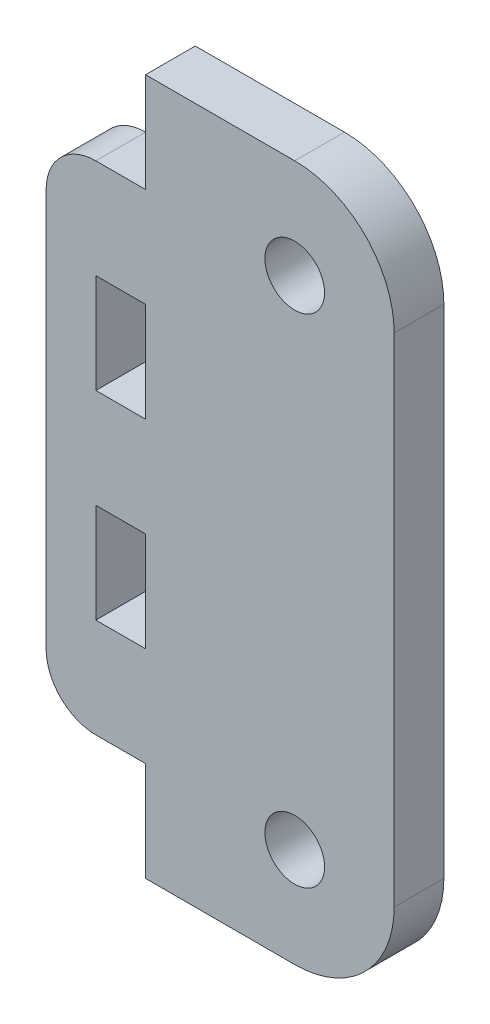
ISO-10303-21;
HEADER;
FILE_DESCRIPTION(('STEP AP214'),'2;1');
FILE_NAME('part.step','',(''),(''),'','','');
FILE_SCHEMA(('AUTOMOTIVE_DESIGN { 1 0 10303 214 1 1 1 1 }'));
ENDSEC;
DATA;
#1=APPLICATION_CONTEXT('core data for automotive mechanical design processes');
#2=APPLICATION_PROTOCOL_DEFINITION('international standard','automotive_design',2000,#1);
#3=PRODUCT_CONTEXT('',#1,'mechanical');
#4=PRODUCT('Part','Part','',(#3));
#5=PRODUCT_RELATED_PRODUCT_CATEGORY('part','',(#4));
#6=PRODUCT_DEFINITION_FORMATION('','',#4);
#7=PRODUCT_DEFINITION_CONTEXT('part definition',#1,'design');
#8=PRODUCT_DEFINITION('design','',#6,#7);
#9=PRODUCT_DEFINITION_SHAPE('','',#8);
#10=(LENGTH_UNIT() NAMED_UNIT(*) SI_UNIT(.MILLI.,.METRE.));
#11=(NAMED_UNIT(*) PLANE_ANGLE_UNIT() SI_UNIT($,.RADIAN.));
#12=(NAMED_UNIT(*) SI_UNIT($,.STERADIAN.) SOLID_ANGLE_UNIT());
#13=UNCERTAINTY_MEASURE_WITH_UNIT(LENGTH_MEASURE(1.E-05),#10,'distance_accuracy_value','');
#14=(GEOMETRIC_REPRESENTATION_CONTEXT(3) GLOBAL_UNCERTAINTY_ASSIGNED_CONTEXT((#13)) GLOBAL_UNIT_ASSIGNED_CONTEXT((#10,
#11,#12)) REPRESENTATION_CONTEXT('',''));
#15=CARTESIAN_POINT('',(0.,0.,0.));
#16=DIRECTION('',(0.,0.,1.));
#17=DIRECTION('',(1.,0.,0.));
#18=AXIS2_PLACEMENT_3D('',#15,#16,#17);
#19=CARTESIAN_POINT('',(0.,0.,5.));
#20=DIRECTION('',(0.,0.,1.));
#21=DIRECTION('',(1.,0.,0.));
#22=AXIS2_PLACEMENT_3D('',#19,#20,#21);
#23=PLANE('',#22);
#24=DIRECTION('',(1.,0.,0.));
#25=VECTOR('',#24,1.);
#26=CARTESIAN_POINT('',(0.,25.,5.));
#27=LINE('',#26,#25);
#28=CARTESIAN_POINT('',(-5.,25.,5.));
#29=VERTEX_POINT('',#28);
#30=CARTESIAN_POINT('',(0.,25.,5.));
#31=VERTEX_POINT('',#30);
#32=EDGE_CURVE('E186',#29,#31,#27,.T.);
#33=ORIENTED_EDGE('',*,*,#32,.F.);
#34=CARTESIAN_POINT('',(-5.,20.,5.));
#35=DIRECTION('',(0.,0.,1.));
#36=DIRECTION('',(1.,0.,0.));
#37=AXIS2_PLACEMENT_3D('',#34,#35,#36);
#38=CIRCLE('',#37,5.);
#39=CARTESIAN_POINT('',(-10.,20.,5.));
#40=VERTEX_POINT('',#39);
#41=EDGE_CURVE('E311',#29,#40,#38,.T.);
#42=ORIENTED_EDGE('',*,*,#41,.T.);
#43=DIRECTION('',(0.,1.,0.));
#44=VECTOR('',#43,1.);
#45=CARTESIAN_POINT('',(-10.,-25.,5.));
#46=LINE('',#45,#44);
#47=CARTESIAN_POINT('',(-10.,-20.,5.));
#48=VERTEX_POINT('',#47);
#49=EDGE_CURVE('E330',#48,#40,#46,.T.);
#50=ORIENTED_EDGE('',*,*,#49,.F.);
#51=CARTESIAN_POINT('',(-5.,-20.,5.));
#52=DIRECTION('',(0.,0.,1.));
#53=DIRECTION('',(1.,0.,0.));
#54=AXIS2_PLACEMENT_3D('',#51,#52,#53);
#55=CIRCLE('',#54,5.);
#56=CARTESIAN_POINT('',(-5.,-25.,5.));
#57=VERTEX_POINT('',#56);
#58=EDGE_CURVE('E309',#48,#57,#55,.T.);
#59=ORIENTED_EDGE('',*,*,#58,.T.);
#60=DIRECTION('',(-1.,0.,0.));
#61=VECTOR('',#60,1.);
#62=CARTESIAN_POINT('',(0.,-25.,5.));
#63=LINE('',#62,#61);
#64=CARTESIAN_POINT('',(0.,-25.,5.));
#65=VERTEX_POINT('',#64);
#66=EDGE_CURVE('E194',#65,#57,#63,.T.);
#67=ORIENTED_EDGE('',*,*,#66,.F.);
#68=DIRECTION('',(0.,-1.,0.));
#69=VECTOR('',#68,1.);
#70=CARTESIAN_POINT('',(0.,35.,5.));
#71=LINE('',#70,#69);
#72=CARTESIAN_POINT('',(0.,-35.,5.));
#73=VERTEX_POINT('',#72);
#74=EDGE_CURVE('E191',#65,#73,#71,.T.);
#75=ORIENTED_EDGE('',*,*,#74,.T.);
#76=DIRECTION('',(-1.,0.,0.));
#77=VECTOR('',#76,1.);
#78=CARTESIAN_POINT('',(25.,-35.,5.));
#79=LINE('',#78,#77);
#80=CARTESIAN_POINT('',(15.,-35.,5.));
#81=VERTEX_POINT('',#80);
#82=EDGE_CURVE('E175',#81,#73,#79,.T.);
#83=ORIENTED_EDGE('',*,*,#82,.F.);
#84=CARTESIAN_POINT('',(15.,-25.,5.));
#85=DIRECTION('',(0.,0.,1.));
#86=DIRECTION('',(1.,0.,0.));
#87=AXIS2_PLACEMENT_3D('',#84,#85,#86);
#88=CIRCLE('',#87,10.);
#89=CARTESIAN_POINT('',(25.,-25.,5.));
#90=VERTEX_POINT('',#89);
#91=EDGE_CURVE('E293',#81,#90,#88,.T.);
#92=ORIENTED_EDGE('',*,*,#91,.T.);
#93=DIRECTION('',(0.,-1.,0.));
#94=VECTOR('',#93,1.);
#95=CARTESIAN_POINT('',(25.,35.,5.));
#96=LINE('',#95,#94);
#97=CARTESIAN_POINT('',(25.,25.,5.));
#98=VERTEX_POINT('',#97);
#99=EDGE_CURVE('E217',#98,#90,#96,.T.);
#100=ORIENTED_EDGE('',*,*,#99,.F.);
#101=CARTESIAN_POINT('',(15.,25.,5.));
#102=DIRECTION('',(0.,0.,1.));
#103=DIRECTION('',(1.,0.,0.));
#104=AXIS2_PLACEMENT_3D('',#101,#102,#103);
#105=CIRCLE('',#104,10.);
#106=CARTESIAN_POINT('',(15.,35.,5.));
#107=VERTEX_POINT('',#106);
#108=EDGE_CURVE('E295',#98,#107,#105,.T.);
#109=ORIENTED_EDGE('',*,*,#108,.T.);
#110=DIRECTION('',(-1.,0.,0.));
#111=VECTOR('',#110,1.);
#112=CARTESIAN_POINT('',(25.,35.,5.));
#113=LINE('',#112,#111);
#114=CARTESIAN_POINT('',(0.,35.,5.));
#115=VERTEX_POINT('',#114);
#116=EDGE_CURVE('E218',#107,#115,#113,.T.);
#117=ORIENTED_EDGE('',*,*,#116,.T.);
#118=EDGE_CURVE('E200',#115,#31,#71,.T.);
#119=ORIENTED_EDGE('',*,*,#118,.T.);
#120=EDGE_LOOP('',(#33,#42,#50,#59,#67,#75,#83,#92,#100,#109,#117,#119));
#121=FACE_BOUND('',#120,.T.);
#122=CARTESIAN_POINT('',(15.,-25.,5.));
#123=DIRECTION('',(0.,0.,1.));
#124=DIRECTION('',(1.,0.,0.));
#125=AXIS2_PLACEMENT_3D('',#122,#123,#124);
#126=CIRCLE('',#125,3.);
#127=CARTESIAN_POINT('',(18.,-25.,5.));
#128=VERTEX_POINT('',#127);
#129=EDGE_CURVE('E333',#128,#128,#126,.T.);
#130=ORIENTED_EDGE('',*,*,#129,.F.);
#131=EDGE_LOOP('',(#130));
#132=FACE_BOUND('',#131,.T.);
#133=CARTESIAN_POINT('',(15.,25.,5.));
#134=DIRECTION('',(0.,0.,1.));
#135=DIRECTION('',(1.,0.,0.));
#136=AXIS2_PLACEMENT_3D('',#133,#134,#135);
#137=CIRCLE('',#136,3.);
#138=CARTESIAN_POINT('',(18.,25.,5.));
#139=VERTEX_POINT('',#138);
#140=EDGE_CURVE('E340',#139,#139,#137,.T.);
#141=ORIENTED_EDGE('',*,*,#140,.F.);
#142=EDGE_LOOP('',(#141));
#143=FACE_BOUND('',#142,.T.);
#144=CARTESIAN_POINT('',(0.,-5.,5.));
#145=VERTEX_POINT('',#144);
#146=CARTESIAN_POINT('',(0.,-15.,5.));
#147=VERTEX_POINT('',#146);
#148=EDGE_CURVE('E197',#145,#147,#71,.T.);
#149=ORIENTED_EDGE('',*,*,#148,.T.);
#150=DIRECTION('',(1.,0.,0.));
#151=VECTOR('',#150,1.);
#152=CARTESIAN_POINT('',(0.,-15.,5.));
#153=LINE('',#152,#151);
#154=CARTESIAN_POINT('',(-5.,-15.,5.));
#155=VERTEX_POINT('',#154);
#156=EDGE_CURVE('E239',#155,#147,#153,.T.);
#157=ORIENTED_EDGE('',*,*,#156,.F.);
#158=DIRECTION('',(0.,-1.,0.));
#159=VECTOR('',#158,1.);
#160=CARTESIAN_POINT('',(-5.,-15.,5.));
#161=LINE('',#160,#159);
#162=CARTESIAN_POINT('',(-5.,-5.,5.));
#163=VERTEX_POINT('',#162);
#164=EDGE_CURVE('E250',#163,#155,#161,.T.);
#165=ORIENTED_EDGE('',*,*,#164,.F.);
#166=DIRECTION('',(-1.,0.,0.));
#167=VECTOR('',#166,1.);
#168=CARTESIAN_POINT('',(0.,-5.,5.));
#169=LINE('',#168,#167);
#170=EDGE_CURVE('E247',#145,#163,#169,.T.);
#171=ORIENTED_EDGE('',*,*,#170,.F.);
#172=EDGE_LOOP('',(#149,#157,#165,#171));
#173=FACE_BOUND('',#172,.T.);
#174=CARTESIAN_POINT('',(0.,15.,5.));
#175=VERTEX_POINT('',#174);
#176=CARTESIAN_POINT('',(0.,5.,5.));
#177=VERTEX_POINT('',#176);
#178=EDGE_CURVE('E210',#175,#177,#71,.T.);
#179=ORIENTED_EDGE('',*,*,#178,.T.);
#180=DIRECTION('',(1.,0.,0.));
#181=VECTOR('',#180,1.);
#182=CARTESIAN_POINT('',(0.,5.,5.));
#183=LINE('',#182,#181);
#184=CARTESIAN_POINT('',(-5.,5.,5.));
#185=VERTEX_POINT('',#184);
#186=EDGE_CURVE('E228',#185,#177,#183,.T.);
#187=ORIENTED_EDGE('',*,*,#186,.F.);
#188=DIRECTION('',(0.,-1.,0.));
#189=VECTOR('',#188,1.);
#190=CARTESIAN_POINT('',(-5.,5.,5.));
#191=LINE('',#190,#189);
#192=CARTESIAN_POINT('',(-5.,15.,5.));
#193=VERTEX_POINT('',#192);
#194=EDGE_CURVE('E233',#193,#185,#191,.T.);
#195=ORIENTED_EDGE('',*,*,#194,.F.);
#196=DIRECTION('',(-1.,0.,0.));
#197=VECTOR('',#196,1.);
#198=CARTESIAN_POINT('',(0.,15.,5.));
#199=LINE('',#198,#197);
#200=EDGE_CURVE('E230',#175,#193,#199,.T.);
#201=ORIENTED_EDGE('',*,*,#200,.F.);
#202=EDGE_LOOP('',(#179,#187,#195,#201));
#203=FACE_BOUND('',#202,.T.);
#204=ADVANCED_FACE('F37',(#121,#132,#143,#173,#203),#23,.T.);
#205=CARTESIAN_POINT('',(0.,0.,0.));
#206=DIRECTION('',(0.,0.,1.));
#207=DIRECTION('',(1.,0.,0.));
#208=AXIS2_PLACEMENT_3D('',#205,#206,#207);
#209=PLANE('',#208);
#210=CARTESIAN_POINT('',(15.,-25.,0.));
#211=DIRECTION('',(0.,0.,1.));
#212=DIRECTION('',(1.,0.,0.));
#213=AXIS2_PLACEMENT_3D('',#210,#211,#212);
#214=CIRCLE('',#213,3.);
#215=CARTESIAN_POINT('',(18.,-25.,0.));
#216=VERTEX_POINT('',#215);
#217=EDGE_CURVE('E336',#216,#216,#214,.T.);
#218=ORIENTED_EDGE('',*,*,#217,.T.);
#219=EDGE_LOOP('',(#218));
#220=FACE_BOUND('',#219,.T.);
#221=CARTESIAN_POINT('',(15.,25.,0.));
#222=DIRECTION('',(0.,0.,1.));
#223=DIRECTION('',(1.,0.,0.));
#224=AXIS2_PLACEMENT_3D('',#221,#222,#223);
#225=CIRCLE('',#224,3.);
#226=CARTESIAN_POINT('',(18.,25.,0.));
#227=VERTEX_POINT('',#226);
#228=EDGE_CURVE('E198',#227,#227,#225,.T.);
#229=ORIENTED_EDGE('',*,*,#228,.T.);
#230=EDGE_LOOP('',(#229));
#231=FACE_BOUND('',#230,.T.);
#232=DIRECTION('',(1.,0.,0.));
#233=VECTOR('',#232,1.);
#234=CARTESIAN_POINT('',(0.,-15.,0.));
#235=LINE('',#234,#233);
#236=CARTESIAN_POINT('',(-5.,-15.,0.));
#237=VERTEX_POINT('',#236);
#238=CARTESIAN_POINT('',(0.,-15.,0.));
#239=VERTEX_POINT('',#238);
#240=EDGE_CURVE('E273',#237,#239,#235,.T.);
#241=ORIENTED_EDGE('',*,*,#240,.T.);
#242=DIRECTION('',(0.,1.,0.));
#243=VECTOR('',#242,1.);
#244=CARTESIAN_POINT('',(0.,35.,0.));
#245=LINE('',#244,#243);
#246=CARTESIAN_POINT('',(0.,-5.,0.));
#247=VERTEX_POINT('',#246);
#248=EDGE_CURVE('E214',#239,#247,#245,.T.);
#249=ORIENTED_EDGE('',*,*,#248,.T.);
#250=DIRECTION('',(-1.,0.,0.));
#251=VECTOR('',#250,1.);
#252=CARTESIAN_POINT('',(0.,-5.,0.));
#253=LINE('',#252,#251);
#254=CARTESIAN_POINT('',(-5.,-5.,0.));
#255=VERTEX_POINT('',#254);
#256=EDGE_CURVE('E267',#247,#255,#253,.T.);
#257=ORIENTED_EDGE('',*,*,#256,.T.);
#258=DIRECTION('',(0.,-1.,0.));
#259=VECTOR('',#258,1.);
#260=CARTESIAN_POINT('',(-5.,0.,0.));
#261=LINE('',#260,#259);
#262=EDGE_CURVE('E270',#255,#237,#261,.T.);
#263=ORIENTED_EDGE('',*,*,#262,.T.);
#264=EDGE_LOOP('',(#241,#249,#257,#263));
#265=FACE_BOUND('',#264,.T.);
#266=DIRECTION('',(1.,0.,0.));
#267=VECTOR('',#266,1.);
#268=CARTESIAN_POINT('',(0.,5.,0.));
#269=LINE('',#268,#267);
#270=CARTESIAN_POINT('',(-5.,5.,0.));
#271=VERTEX_POINT('',#270);
#272=CARTESIAN_POINT('',(0.,5.,0.));
#273=VERTEX_POINT('',#272);
#274=EDGE_CURVE('E282',#271,#273,#269,.T.);
#275=ORIENTED_EDGE('',*,*,#274,.T.);
#276=CARTESIAN_POINT('',(0.,15.,0.));
#277=VERTEX_POINT('',#276);
#278=EDGE_CURVE('E207',#273,#277,#245,.T.);
#279=ORIENTED_EDGE('',*,*,#278,.T.);
#280=DIRECTION('',(-1.,0.,0.));
#281=VECTOR('',#280,1.);
#282=CARTESIAN_POINT('',(0.,15.,0.));
#283=LINE('',#282,#281);
#284=CARTESIAN_POINT('',(-5.,15.,0.));
#285=VERTEX_POINT('',#284);
#286=EDGE_CURVE('E276',#277,#285,#283,.T.);
#287=ORIENTED_EDGE('',*,*,#286,.T.);
#288=DIRECTION('',(0.,-1.,0.));
#289=VECTOR('',#288,1.);
#290=CARTESIAN_POINT('',(-5.,0.,0.));
#291=LINE('',#290,#289);
#292=EDGE_CURVE('E279',#285,#271,#291,.T.);
#293=ORIENTED_EDGE('',*,*,#292,.T.);
#294=EDGE_LOOP('',(#275,#279,#287,#293));
#295=FACE_BOUND('',#294,.T.);
#296=DIRECTION('',(0.,1.,0.));
#297=VECTOR('',#296,1.);
#298=CARTESIAN_POINT('',(-10.,0.,0.));
#299=LINE('',#298,#297);
#300=CARTESIAN_POINT('',(-10.,-20.,0.));
#301=VERTEX_POINT('',#300);
#302=CARTESIAN_POINT('',(-10.,20.,0.));
#303=VERTEX_POINT('',#302);
#304=EDGE_CURVE('E304',#301,#303,#299,.T.);
#305=ORIENTED_EDGE('',*,*,#304,.T.);
#306=CARTESIAN_POINT('',(-5.,20.,0.));
#307=DIRECTION('',(0.,0.,1.));
#308=DIRECTION('',(1.,0.,0.));
#309=AXIS2_PLACEMENT_3D('',#306,#307,#308);
#310=CIRCLE('',#309,5.);
#311=CARTESIAN_POINT('',(-5.,25.,0.));
#312=VERTEX_POINT('',#311);
#313=EDGE_CURVE('E45',#303,#312,#310,.F.);
#314=ORIENTED_EDGE('',*,*,#313,.T.);
#315=DIRECTION('',(1.,0.,0.));
#316=VECTOR('',#315,1.);
#317=CARTESIAN_POINT('',(0.,25.,0.));
#318=LINE('',#317,#316);
#319=CARTESIAN_POINT('',(0.,25.,0.));
#320=VERTEX_POINT('',#319);
#321=EDGE_CURVE('E285',#312,#320,#318,.T.);
#322=ORIENTED_EDGE('',*,*,#321,.T.);
#323=CARTESIAN_POINT('',(0.,35.,0.));
#324=VERTEX_POINT('',#323);
#325=EDGE_CURVE('E204',#320,#324,#245,.T.);
#326=ORIENTED_EDGE('',*,*,#325,.T.);
#327=DIRECTION('',(-1.,0.,0.));
#328=VECTOR('',#327,1.);
#329=CARTESIAN_POINT('',(25.,35.,0.));
#330=LINE('',#329,#328);
#331=CARTESIAN_POINT('',(15.,35.,0.));
#332=VERTEX_POINT('',#331);
#333=EDGE_CURVE('E220',#332,#324,#330,.T.);
#334=ORIENTED_EDGE('',*,*,#333,.F.);
#335=CARTESIAN_POINT('',(15.,25.,0.));
#336=DIRECTION('',(0.,0.,1.));
#337=DIRECTION('',(1.,0.,0.));
#338=AXIS2_PLACEMENT_3D('',#335,#336,#337);
#339=CIRCLE('',#338,10.);
#340=CARTESIAN_POINT('',(25.,25.,0.));
#341=VERTEX_POINT('',#340);
#342=EDGE_CURVE('E301',#332,#341,#339,.F.);
#343=ORIENTED_EDGE('',*,*,#342,.T.);
#344=DIRECTION('',(0.,1.,0.));
#345=VECTOR('',#344,1.);
#346=CARTESIAN_POINT('',(25.,35.,0.));
#347=LINE('',#346,#345);
#348=CARTESIAN_POINT('',(25.,-25.,0.));
#349=VERTEX_POINT('',#348);
#350=EDGE_CURVE('E221',#349,#341,#347,.T.);
#351=ORIENTED_EDGE('',*,*,#350,.F.);
#352=CARTESIAN_POINT('',(15.,-25.,0.));
#353=DIRECTION('',(0.,0.,1.));
#354=DIRECTION('',(1.,0.,0.));
#355=AXIS2_PLACEMENT_3D('',#352,#353,#354);
#356=CIRCLE('',#355,10.);
#357=CARTESIAN_POINT('',(15.,-35.,0.));
#358=VERTEX_POINT('',#357);
#359=EDGE_CURVE('E299',#349,#358,#356,.F.);
#360=ORIENTED_EDGE('',*,*,#359,.T.);
#361=DIRECTION('',(-1.,0.,0.));
#362=VECTOR('',#361,1.);
#363=CARTESIAN_POINT('',(25.,-35.,0.));
#364=LINE('',#363,#362);
#365=CARTESIAN_POINT('',(0.,-35.,0.));
#366=VERTEX_POINT('',#365);
#367=EDGE_CURVE('E187',#358,#366,#364,.T.);
#368=ORIENTED_EDGE('',*,*,#367,.T.);
#369=CARTESIAN_POINT('',(0.,-25.,0.));
#370=VERTEX_POINT('',#369);
#371=EDGE_CURVE('E203',#366,#370,#245,.T.);
#372=ORIENTED_EDGE('',*,*,#371,.T.);
#373=DIRECTION('',(-1.,0.,0.));
#374=VECTOR('',#373,1.);
#375=CARTESIAN_POINT('',(0.,-25.,0.));
#376=LINE('',#375,#374);
#377=CARTESIAN_POINT('',(-5.,-25.,0.));
#378=VERTEX_POINT('',#377);
#379=EDGE_CURVE('E265',#370,#378,#376,.T.);
#380=ORIENTED_EDGE('',*,*,#379,.T.);
#381=CARTESIAN_POINT('',(-5.,-20.,0.));
#382=DIRECTION('',(0.,0.,1.));
#383=DIRECTION('',(1.,0.,0.));
#384=AXIS2_PLACEMENT_3D('',#381,#382,#383);
#385=CIRCLE('',#384,5.);
#386=EDGE_CURVE('E317',#378,#301,#385,.F.);
#387=ORIENTED_EDGE('',*,*,#386,.T.);
#388=EDGE_LOOP('',(#305,#314,#322,#326,#334,#343,#351,#360,#368,#372,#380,#387));
#389=FACE_BOUND('',#388,.T.);
#390=ADVANCED_FACE('F321',(#220,#231,#265,#295,#389),#209,.F.);
#391=CARTESIAN_POINT('',(0.,-25.,-5.));
#392=DIRECTION('',(0.,1.,0.));
#393=DIRECTION('',(0.,0.,1.));
#394=AXIS2_PLACEMENT_3D('',#391,#392,#393);
#395=PLANE('',#394);
#396=ORIENTED_EDGE('',*,*,#66,.T.);
#397=DIRECTION('',(0.,0.,1.));
#398=VECTOR('',#397,1.);
#399=CARTESIAN_POINT('',(-5.,-25.,-5.));
#400=LINE('',#399,#398);
#401=EDGE_CURVE('E11',#57,#378,#400,.F.);
#402=ORIENTED_EDGE('',*,*,#401,.T.);
#403=ORIENTED_EDGE('',*,*,#379,.F.);
#404=DIRECTION('',(0.,0.,1.));
#405=VECTOR('',#404,1.);
#406=CARTESIAN_POINT('',(0.,-25.,-5.));
#407=LINE('',#406,#405);
#408=EDGE_CURVE('E263',#370,#65,#407,.T.);
#409=ORIENTED_EDGE('',*,*,#408,.T.);
#410=EDGE_LOOP('',(#396,#402,#403,#409));
#411=FACE_BOUND('',#410,.T.);
#412=ADVANCED_FACE('F384',(#411),#395,.F.);
#413=CARTESIAN_POINT('',(0.,-15.,-5.));
#414=DIRECTION('',(0.,-1.,0.));
#415=DIRECTION('',(0.,0.,-1.));
#416=AXIS2_PLACEMENT_3D('',#413,#414,#415);
#417=PLANE('',#416);
#418=DIRECTION('',(0.,0.,1.));
#419=VECTOR('',#418,1.);
#420=CARTESIAN_POINT('',(-5.,-15.,-5.));
#421=LINE('',#420,#419);
#422=EDGE_CURVE('E254',#237,#155,#421,.T.);
#423=ORIENTED_EDGE('',*,*,#422,.T.);
#424=ORIENTED_EDGE('',*,*,#156,.T.);
#425=DIRECTION('',(0.,0.,1.));
#426=VECTOR('',#425,1.);
#427=CARTESIAN_POINT('',(0.,-15.,-5.));
#428=LINE('',#427,#426);
#429=EDGE_CURVE('E253',#239,#147,#428,.T.);
#430=ORIENTED_EDGE('',*,*,#429,.F.);
#431=ORIENTED_EDGE('',*,*,#240,.F.);
#432=EDGE_LOOP('',(#423,#424,#430,#431));
#433=FACE_BOUND('',#432,.T.);
#434=ADVANCED_FACE('F437',(#433),#417,.F.);
#435=CARTESIAN_POINT('',(-5.,-15.,-5.));
#436=DIRECTION('',(-1.,0.,0.));
#437=DIRECTION('',(0.,-1.,0.));
#438=AXIS2_PLACEMENT_3D('',#435,#436,#437);
#439=PLANE('',#438);
#440=DIRECTION('',(0.,0.,1.));
#441=VECTOR('',#440,1.);
#442=CARTESIAN_POINT('',(-5.,-5.,-5.));
#443=LINE('',#442,#441);
#444=EDGE_CURVE('E256',#255,#163,#443,.T.);
#445=ORIENTED_EDGE('',*,*,#444,.T.);
#446=ORIENTED_EDGE('',*,*,#164,.T.);
#447=ORIENTED_EDGE('',*,*,#422,.F.);
#448=ORIENTED_EDGE('',*,*,#262,.F.);
#449=EDGE_LOOP('',(#445,#446,#447,#448));
#450=FACE_BOUND('',#449,.T.);
#451=ADVANCED_FACE('F434',(#450),#439,.F.);
#452=CARTESIAN_POINT('',(0.,-5.,-5.));
#453=DIRECTION('',(0.,1.,0.));
#454=DIRECTION('',(0.,0.,1.));
#455=AXIS2_PLACEMENT_3D('',#452,#453,#454);
#456=PLANE('',#455);
#457=DIRECTION('',(0.,0.,1.));
#458=VECTOR('',#457,1.);
#459=CARTESIAN_POINT('',(0.,-5.,-5.));
#460=LINE('',#459,#458);
#461=EDGE_CURVE('E258',#247,#145,#460,.T.);
#462=ORIENTED_EDGE('',*,*,#461,.T.);
#463=ORIENTED_EDGE('',*,*,#170,.T.);
#464=ORIENTED_EDGE('',*,*,#444,.F.);
#465=ORIENTED_EDGE('',*,*,#256,.F.);
#466=EDGE_LOOP('',(#462,#463,#464,#465));
#467=FACE_BOUND('',#466,.T.);
#468=ADVANCED_FACE('F432',(#467),#456,.F.);
#469=CARTESIAN_POINT('',(0.,5.,-5.));
#470=DIRECTION('',(0.,-1.,0.));
#471=DIRECTION('',(0.,0.,-1.));
#472=AXIS2_PLACEMENT_3D('',#469,#470,#471);
#473=PLANE('',#472);
#474=DIRECTION('',(0.,0.,1.));
#475=VECTOR('',#474,1.);
#476=CARTESIAN_POINT('',(-5.,5.,-5.));
#477=LINE('',#476,#475);
#478=EDGE_CURVE('E237',#271,#185,#477,.T.);
#479=ORIENTED_EDGE('',*,*,#478,.T.);
#480=ORIENTED_EDGE('',*,*,#186,.T.);
#481=DIRECTION('',(0.,0.,1.));
#482=VECTOR('',#481,1.);
#483=CARTESIAN_POINT('',(0.,5.,-5.));
#484=LINE('',#483,#482);
#485=EDGE_CURVE('E236',#273,#177,#484,.T.);
#486=ORIENTED_EDGE('',*,*,#485,.F.);
#487=ORIENTED_EDGE('',*,*,#274,.F.);
#488=EDGE_LOOP('',(#479,#480,#486,#487));
#489=FACE_BOUND('',#488,.T.);
#490=ADVANCED_FACE('F425',(#489),#473,.F.);
#491=CARTESIAN_POINT('',(-5.,5.,-5.));
#492=DIRECTION('',(-1.,0.,0.));
#493=DIRECTION('',(0.,-1.,0.));
#494=AXIS2_PLACEMENT_3D('',#491,#492,#493);
#495=PLANE('',#494);
#496=DIRECTION('',(0.,0.,1.));
#497=VECTOR('',#496,1.);
#498=CARTESIAN_POINT('',(-5.,15.,-5.));
#499=LINE('',#498,#497);
#500=EDGE_CURVE('E240',#285,#193,#499,.T.);
#501=ORIENTED_EDGE('',*,*,#500,.T.);
#502=ORIENTED_EDGE('',*,*,#194,.T.);
#503=ORIENTED_EDGE('',*,*,#478,.F.);
#504=ORIENTED_EDGE('',*,*,#292,.F.);
#505=EDGE_LOOP('',(#501,#502,#503,#504));
#506=FACE_BOUND('',#505,.T.);
#507=ADVANCED_FACE('F422',(#506),#495,.F.);
#508=CARTESIAN_POINT('',(0.,15.,-5.));
#509=DIRECTION('',(0.,1.,0.));
#510=DIRECTION('',(0.,0.,1.));
#511=AXIS2_PLACEMENT_3D('',#508,#509,#510);
#512=PLANE('',#511);
#513=DIRECTION('',(0.,0.,1.));
#514=VECTOR('',#513,1.);
#515=CARTESIAN_POINT('',(0.,15.,-5.));
#516=LINE('',#515,#514);
#517=EDGE_CURVE('E242',#277,#175,#516,.T.);
#518=ORIENTED_EDGE('',*,*,#517,.T.);
#519=ORIENTED_EDGE('',*,*,#200,.T.);
#520=ORIENTED_EDGE('',*,*,#500,.F.);
#521=ORIENTED_EDGE('',*,*,#286,.F.);
#522=EDGE_LOOP('',(#518,#519,#520,#521));
#523=FACE_BOUND('',#522,.T.);
#524=ADVANCED_FACE('F421',(#523),#512,.F.);
#525=CARTESIAN_POINT('',(0.,25.,-5.));
#526=DIRECTION('',(0.,-1.,0.));
#527=DIRECTION('',(0.,0.,-1.));
#528=AXIS2_PLACEMENT_3D('',#525,#526,#527);
#529=PLANE('',#528);
#530=ORIENTED_EDGE('',*,*,#321,.F.);
#531=DIRECTION('',(0.,0.,1.));
#532=VECTOR('',#531,1.);
#533=CARTESIAN_POINT('',(-5.,25.,-5.));
#534=LINE('',#533,#532);
#535=EDGE_CURVE('E306',#312,#29,#534,.T.);
#536=ORIENTED_EDGE('',*,*,#535,.T.);
#537=ORIENTED_EDGE('',*,*,#32,.T.);
#538=DIRECTION('',(0.,0.,1.));
#539=VECTOR('',#538,1.);
#540=CARTESIAN_POINT('',(0.,25.,-5.));
#541=LINE('',#540,#539);
#542=EDGE_CURVE('E225',#320,#31,#541,.T.);
#543=ORIENTED_EDGE('',*,*,#542,.F.);
#544=EDGE_LOOP('',(#530,#536,#537,#543));
#545=FACE_BOUND('',#544,.T.);
#546=ADVANCED_FACE('F326',(#545),#529,.F.);
#547=CARTESIAN_POINT('',(0.,0.,0.));
#548=DIRECTION('',(1.,0.,0.));
#549=DIRECTION('',(0.,0.,-1.));
#550=AXIS2_PLACEMENT_3D('',#547,#548,#549);
#551=PLANE('',#550);
#552=ORIENTED_EDGE('',*,*,#74,.F.);
#553=ORIENTED_EDGE('',*,*,#408,.F.);
#554=ORIENTED_EDGE('',*,*,#371,.F.);
#555=DIRECTION('',(0.,0.,-1.));
#556=VECTOR('',#555,1.);
#557=CARTESIAN_POINT('',(0.,-35.,5.));
#558=LINE('',#557,#556);
#559=EDGE_CURVE('E180',#73,#366,#558,.T.);
#560=ORIENTED_EDGE('',*,*,#559,.F.);
#561=EDGE_LOOP('',(#552,#553,#554,#560));
#562=FACE_BOUND('',#561,.T.);
#563=ADVANCED_FACE('F201',(#562),#551,.F.);
#564=ORIENTED_EDGE('',*,*,#248,.F.);
#565=ORIENTED_EDGE('',*,*,#429,.T.);
#566=ORIENTED_EDGE('',*,*,#148,.F.);
#567=ORIENTED_EDGE('',*,*,#461,.F.);
#568=EDGE_LOOP('',(#564,#565,#566,#567));
#569=FACE_BOUND('',#568,.T.);
#570=ADVANCED_FACE('F374',(#569),#551,.F.);
#571=ORIENTED_EDGE('',*,*,#278,.F.);
#572=ORIENTED_EDGE('',*,*,#485,.T.);
#573=ORIENTED_EDGE('',*,*,#178,.F.);
#574=ORIENTED_EDGE('',*,*,#517,.F.);
#575=EDGE_LOOP('',(#571,#572,#573,#574));
#576=FACE_BOUND('',#575,.T.);
#577=ADVANCED_FACE('F367',(#576),#551,.F.);
#578=ORIENTED_EDGE('',*,*,#325,.F.);
#579=ORIENTED_EDGE('',*,*,#542,.T.);
#580=ORIENTED_EDGE('',*,*,#118,.F.);
#581=DIRECTION('',(0.,0.,1.));
#582=VECTOR('',#581,1.);
#583=CARTESIAN_POINT('',(0.,35.,5.));
#584=LINE('',#583,#582);
#585=EDGE_CURVE('E213',#324,#115,#584,.T.);
#586=ORIENTED_EDGE('',*,*,#585,.F.);
#587=EDGE_LOOP('',(#578,#579,#580,#586));
#588=FACE_BOUND('',#587,.T.);
#589=ADVANCED_FACE('F365',(#588),#551,.F.);
#590=CARTESIAN_POINT('',(25.,-35.,5.));
#591=DIRECTION('',(0.,1.,0.));
#592=DIRECTION('',(0.,0.,1.));
#593=AXIS2_PLACEMENT_3D('',#590,#591,#592);
#594=PLANE('',#593);
#595=ORIENTED_EDGE('',*,*,#367,.F.);
#596=DIRECTION('',(0.,0.,-1.));
#597=VECTOR('',#596,1.);
#598=CARTESIAN_POINT('',(15.,-35.,5.));
#599=LINE('',#598,#597);
#600=EDGE_CURVE('E183',#358,#81,#599,.F.);
#601=ORIENTED_EDGE('',*,*,#600,.T.);
#602=ORIENTED_EDGE('',*,*,#82,.T.);
#603=ORIENTED_EDGE('',*,*,#559,.T.);
#604=EDGE_LOOP('',(#595,#601,#602,#603));
#605=FACE_BOUND('',#604,.T.);
#606=ADVANCED_FACE('F178',(#605),#594,.F.);
#607=CARTESIAN_POINT('',(25.,35.,5.));
#608=DIRECTION('',(0.,-1.,0.));
#609=DIRECTION('',(0.,0.,-1.));
#610=AXIS2_PLACEMENT_3D('',#607,#608,#609);
#611=PLANE('',#610);
#612=ORIENTED_EDGE('',*,*,#116,.F.);
#613=DIRECTION('',(0.,0.,1.));
#614=VECTOR('',#613,1.);
#615=CARTESIAN_POINT('',(15.,35.,0.));
#616=LINE('',#615,#614);
#617=EDGE_CURVE('E297',#107,#332,#616,.F.);
#618=ORIENTED_EDGE('',*,*,#617,.T.);
#619=ORIENTED_EDGE('',*,*,#333,.T.);
#620=ORIENTED_EDGE('',*,*,#585,.T.);
#621=EDGE_LOOP('',(#612,#618,#619,#620));
#622=FACE_BOUND('',#621,.T.);
#623=ADVANCED_FACE('F360',(#622),#611,.F.);
#624=CARTESIAN_POINT('',(25.,0.,0.));
#625=DIRECTION('',(1.,0.,0.));
#626=DIRECTION('',(0.,0.,-1.));
#627=AXIS2_PLACEMENT_3D('',#624,#625,#626);
#628=PLANE('',#627);
#629=ORIENTED_EDGE('',*,*,#350,.T.);
#630=DIRECTION('',(0.,0.,1.));
#631=VECTOR('',#630,1.);
#632=CARTESIAN_POINT('',(25.,25.,5.));
#633=LINE('',#632,#631);
#634=EDGE_CURVE('E290',#341,#98,#633,.T.);
#635=ORIENTED_EDGE('',*,*,#634,.T.);
#636=ORIENTED_EDGE('',*,*,#99,.T.);
#637=DIRECTION('',(0.,0.,-1.));
#638=VECTOR('',#637,1.);
#639=CARTESIAN_POINT('',(25.,-25.,0.));
#640=LINE('',#639,#638);
#641=EDGE_CURVE('E287',#90,#349,#640,.T.);
#642=ORIENTED_EDGE('',*,*,#641,.T.);
#643=EDGE_LOOP('',(#629,#635,#636,#642));
#644=FACE_BOUND('',#643,.T.);
#645=ADVANCED_FACE('F351',(#644),#628,.T.);
#646=CARTESIAN_POINT('',(15.,25.,0.));
#647=DIRECTION('',(0.,0.,1.));
#648=DIRECTION('',(1.,0.,0.));
#649=AXIS2_PLACEMENT_3D('',#646,#647,#648);
#650=CYLINDRICAL_SURFACE('',#649,3.);
#651=ORIENTED_EDGE('',*,*,#228,.F.);
#652=EDGE_LOOP('',(#651));
#653=FACE_BOUND('',#652,.T.);
#654=ORIENTED_EDGE('',*,*,#140,.T.);
#655=EDGE_LOOP('',(#654));
#656=FACE_BOUND('',#655,.T.);
#657=ADVANCED_FACE('F408',(#653,#656),#650,.F.);
#658=CARTESIAN_POINT('',(15.,-25.,0.));
#659=DIRECTION('',(0.,0.,1.));
#660=DIRECTION('',(1.,0.,0.));
#661=AXIS2_PLACEMENT_3D('',#658,#659,#660);
#662=CYLINDRICAL_SURFACE('',#661,3.);
#663=ORIENTED_EDGE('',*,*,#217,.F.);
#664=EDGE_LOOP('',(#663));
#665=FACE_BOUND('',#664,.T.);
#666=ORIENTED_EDGE('',*,*,#129,.T.);
#667=EDGE_LOOP('',(#666));
#668=FACE_BOUND('',#667,.T.);
#669=ADVANCED_FACE('F393',(#665,#668),#662,.F.);
#670=CARTESIAN_POINT('',(15.,25.,0.));
#671=DIRECTION('',(0.,0.,-1.));
#672=DIRECTION('',(-1.,0.,0.));
#673=AXIS2_PLACEMENT_3D('',#670,#671,#672);
#674=CYLINDRICAL_SURFACE('',#673,10.);
#675=ORIENTED_EDGE('',*,*,#342,.F.);
#676=ORIENTED_EDGE('',*,*,#617,.F.);
#677=ORIENTED_EDGE('',*,*,#108,.F.);
#678=ORIENTED_EDGE('',*,*,#634,.F.);
#679=EDGE_LOOP('',(#675,#676,#677,#678));
#680=FACE_BOUND('',#679,.T.);
#681=ADVANCED_FACE('F356',(#680),#674,.T.);
#682=CARTESIAN_POINT('',(15.,-25.,0.));
#683=DIRECTION('',(0.,0.,1.));
#684=DIRECTION('',(1.,0.,0.));
#685=AXIS2_PLACEMENT_3D('',#682,#683,#684);
#686=CYLINDRICAL_SURFACE('',#685,10.);
#687=ORIENTED_EDGE('',*,*,#91,.F.);
#688=ORIENTED_EDGE('',*,*,#600,.F.);
#689=ORIENTED_EDGE('',*,*,#359,.F.);
#690=ORIENTED_EDGE('',*,*,#641,.F.);
#691=EDGE_LOOP('',(#687,#688,#689,#690));
#692=FACE_BOUND('',#691,.T.);
#693=ADVANCED_FACE('F392',(#692),#686,.T.);
#694=CARTESIAN_POINT('',(-10.,-25.,-5.));
#695=DIRECTION('',(1.,0.,0.));
#696=DIRECTION('',(0.,1.,0.));
#697=AXIS2_PLACEMENT_3D('',#694,#695,#696);
#698=PLANE('',#697);
#699=ORIENTED_EDGE('',*,*,#49,.T.);
#700=DIRECTION('',(0.,0.,1.));
#701=VECTOR('',#700,1.);
#702=CARTESIAN_POINT('',(-10.,20.,-5.));
#703=LINE('',#702,#701);
#704=EDGE_CURVE('E58',#40,#303,#703,.F.);
#705=ORIENTED_EDGE('',*,*,#704,.T.);
#706=ORIENTED_EDGE('',*,*,#304,.F.);
#707=DIRECTION('',(0.,0.,1.));
#708=VECTOR('',#707,1.);
#709=CARTESIAN_POINT('',(-10.,-20.,-5.));
#710=LINE('',#709,#708);
#711=EDGE_CURVE('E313',#301,#48,#710,.T.);
#712=ORIENTED_EDGE('',*,*,#711,.T.);
#713=EDGE_LOOP('',(#699,#705,#706,#712));
#714=FACE_BOUND('',#713,.T.);
#715=ADVANCED_FACE('F331',(#714),#698,.F.);
#716=CARTESIAN_POINT('',(-5.,20.,-5.));
#717=DIRECTION('',(0.,0.,1.));
#718=DIRECTION('',(1.,0.,0.));
#719=AXIS2_PLACEMENT_3D('',#716,#717,#718);
#720=CYLINDRICAL_SURFACE('',#719,5.);
#721=ORIENTED_EDGE('',*,*,#313,.F.);
#722=ORIENTED_EDGE('',*,*,#704,.F.);
#723=ORIENTED_EDGE('',*,*,#41,.F.);
#724=ORIENTED_EDGE('',*,*,#535,.F.);
#725=EDGE_LOOP('',(#721,#722,#723,#724));
#726=FACE_BOUND('',#725,.T.);
#727=ADVANCED_FACE('F328',(#726),#720,.T.);
#728=CARTESIAN_POINT('',(-5.,-20.,-5.));
#729=DIRECTION('',(0.,0.,1.));
#730=DIRECTION('',(1.,0.,0.));
#731=AXIS2_PLACEMENT_3D('',#728,#729,#730);
#732=CYLINDRICAL_SURFACE('',#731,5.);
#733=ORIENTED_EDGE('',*,*,#386,.F.);
#734=ORIENTED_EDGE('',*,*,#401,.F.);
#735=ORIENTED_EDGE('',*,*,#58,.F.);
#736=ORIENTED_EDGE('',*,*,#711,.F.);
#737=EDGE_LOOP('',(#733,#734,#735,#736));
#738=FACE_BOUND('',#737,.T.);
#739=ADVANCED_FACE('F39',(#738),#732,.T.);
#740=CLOSED_SHELL('',(#204,#390,#412,#434,#451,#468,#490,#507,#524,#546,#563,#570,#577,#589,
#606,#623,#645,#657,#669,#681,#693,#715,#727,#739));
#741=MANIFOLD_SOLID_BREP('B2',#740);
#742=ADVANCED_BREP_SHAPE_REPRESENTATION('',(#18,#741),#14);
#743=SHAPE_DEFINITION_REPRESENTATION(#9,#742);
ENDSEC;
END-ISO-10303-21;
